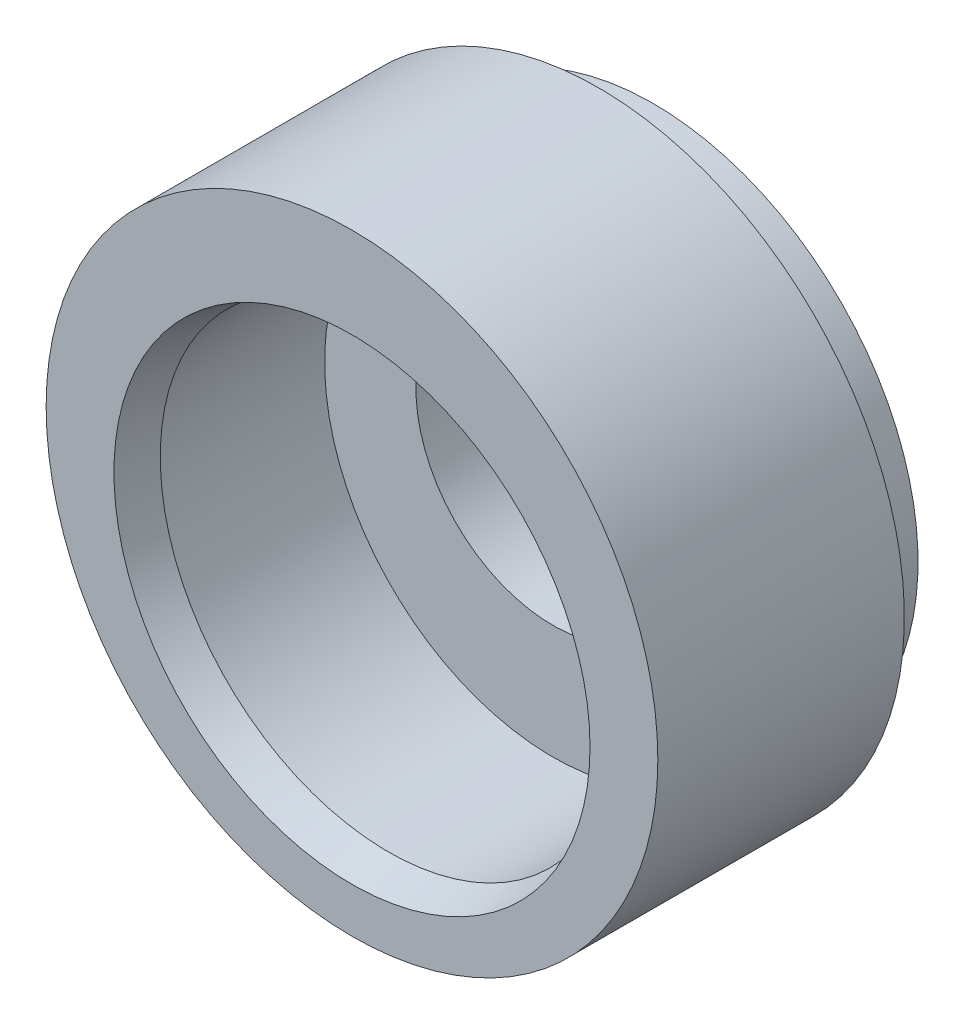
ISO-10303-21;
HEADER;
FILE_DESCRIPTION(('STEP AP214'),'2;1');
FILE_NAME('part.step','',(''),(''),'','','');
FILE_SCHEMA(('AUTOMOTIVE_DESIGN { 1 0 10303 214 1 1 1 1 }'));
ENDSEC;
DATA;
#1=APPLICATION_CONTEXT('core data for automotive mechanical design processes');
#2=APPLICATION_PROTOCOL_DEFINITION('international standard','automotive_design',2000,#1);
#3=PRODUCT_CONTEXT('',#1,'mechanical');
#4=PRODUCT('Part','Part','',(#3));
#5=PRODUCT_RELATED_PRODUCT_CATEGORY('part','',(#4));
#6=PRODUCT_DEFINITION_FORMATION('','',#4);
#7=PRODUCT_DEFINITION_CONTEXT('part definition',#1,'design');
#8=PRODUCT_DEFINITION('design','',#6,#7);
#9=PRODUCT_DEFINITION_SHAPE('','',#8);
#10=(LENGTH_UNIT() NAMED_UNIT(*) SI_UNIT(.MILLI.,.METRE.));
#11=(NAMED_UNIT(*) PLANE_ANGLE_UNIT() SI_UNIT($,.RADIAN.));
#12=(NAMED_UNIT(*) SI_UNIT($,.STERADIAN.) SOLID_ANGLE_UNIT());
#13=UNCERTAINTY_MEASURE_WITH_UNIT(LENGTH_MEASURE(1.E-05),#10,'distance_accuracy_value','');
#14=(GEOMETRIC_REPRESENTATION_CONTEXT(3) GLOBAL_UNCERTAINTY_ASSIGNED_CONTEXT((#13)) GLOBAL_UNIT_ASSIGNED_CONTEXT((#10,
#11,#12)) REPRESENTATION_CONTEXT('',''));
#15=CARTESIAN_POINT('',(0.,0.,0.));
#16=DIRECTION('',(0.,0.,1.));
#17=DIRECTION('',(1.,0.,0.));
#18=AXIS2_PLACEMENT_3D('',#15,#16,#17);
#19=CARTESIAN_POINT('',(0.,0.,0.));
#20=DIRECTION('',(0.,0.,1.));
#21=DIRECTION('',(1.,0.,0.));
#22=AXIS2_PLACEMENT_3D('',#19,#20,#21);
#23=PLANE('',#22);
#24=CARTESIAN_POINT('',(0.,0.,0.));
#25=DIRECTION('',(0.,0.,1.));
#26=DIRECTION('',(1.,0.,0.));
#27=AXIS2_PLACEMENT_3D('',#24,#25,#26);
#28=CIRCLE('',#27,3.81);
#29=CARTESIAN_POINT('',(3.81,0.,0.));
#30=VERTEX_POINT('',#29);
#31=EDGE_CURVE('E60',#30,#30,#28,.T.);
#32=ORIENTED_EDGE('',*,*,#31,.T.);
#33=EDGE_LOOP('',(#32));
#34=FACE_BOUND('',#33,.T.);
#35=CARTESIAN_POINT('',(0.,0.,0.));
#36=DIRECTION('',(0.,0.,-1.));
#37=DIRECTION('',(-1.,0.,0.));
#38=AXIS2_PLACEMENT_3D('',#35,#36,#37);
#39=CIRCLE('',#38,7.366);
#40=CARTESIAN_POINT('',(-7.366,0.,0.));
#41=VERTEX_POINT('',#40);
#42=EDGE_CURVE('E77',#41,#41,#39,.T.);
#43=ORIENTED_EDGE('',*,*,#42,.T.);
#44=EDGE_LOOP('',(#43));
#45=FACE_BOUND('',#44,.T.);
#46=ADVANCED_FACE('F45',(#34,#45),#23,.F.);
#47=CARTESIAN_POINT('',(0.,0.,8.382));
#48=DIRECTION('',(0.,0.,-1.));
#49=DIRECTION('',(-1.,0.,0.));
#50=AXIS2_PLACEMENT_3D('',#47,#48,#49);
#51=CYLINDRICAL_SURFACE('',#50,8.509);
#52=CARTESIAN_POINT('',(0.,0.,8.382));
#53=DIRECTION('',(0.,0.,1.));
#54=DIRECTION('',(1.,0.,0.));
#55=AXIS2_PLACEMENT_3D('',#52,#53,#54);
#56=CIRCLE('',#55,8.509);
#57=CARTESIAN_POINT('',(8.509,0.,8.382));
#58=VERTEX_POINT('',#57);
#59=EDGE_CURVE('E56',#58,#58,#56,.T.);
#60=ORIENTED_EDGE('',*,*,#59,.F.);
#61=EDGE_LOOP('',(#60));
#62=FACE_BOUND('',#61,.T.);
#63=CARTESIAN_POINT('',(0.,0.,1.524));
#64=DIRECTION('',(0.,0.,-1.));
#65=DIRECTION('',(-1.,0.,0.));
#66=AXIS2_PLACEMENT_3D('',#63,#64,#65);
#67=CIRCLE('',#66,8.509);
#68=CARTESIAN_POINT('',(-8.509,0.,1.524));
#69=VERTEX_POINT('',#68);
#70=EDGE_CURVE('E63',#69,#69,#67,.T.);
#71=ORIENTED_EDGE('',*,*,#70,.F.);
#72=EDGE_LOOP('',(#71));
#73=FACE_BOUND('',#72,.T.);
#74=ADVANCED_FACE('F47',(#62,#73),#51,.T.);
#75=CARTESIAN_POINT('',(0.,0.,8.382));
#76=DIRECTION('',(0.,0.,-1.));
#77=DIRECTION('',(-1.,0.,0.));
#78=AXIS2_PLACEMENT_3D('',#75,#76,#77);
#79=CYLINDRICAL_SURFACE('',#78,3.81);
#80=ORIENTED_EDGE('',*,*,#31,.F.);
#81=EDGE_LOOP('',(#80));
#82=FACE_BOUND('',#81,.T.);
#83=CARTESIAN_POINT('',(0.,0.,2.794));
#84=DIRECTION('',(0.,0.,1.));
#85=DIRECTION('',(1.,0.,0.));
#86=AXIS2_PLACEMENT_3D('',#83,#84,#85);
#87=CIRCLE('',#86,3.81);
#88=CARTESIAN_POINT('',(3.81,0.,2.794));
#89=VERTEX_POINT('',#88);
#90=EDGE_CURVE('E68',#89,#89,#87,.T.);
#91=ORIENTED_EDGE('',*,*,#90,.T.);
#92=EDGE_LOOP('',(#91));
#93=FACE_BOUND('',#92,.T.);
#94=ADVANCED_FACE('F103',(#82,#93),#79,.F.);
#95=CARTESIAN_POINT('',(0.,0.,8.382));
#96=DIRECTION('',(0.,0.,1.));
#97=DIRECTION('',(1.,0.,0.));
#98=AXIS2_PLACEMENT_3D('',#95,#96,#97);
#99=PLANE('',#98);
#100=CARTESIAN_POINT('',(0.,-0.635,8.382));
#101=DIRECTION('',(0.,0.,1.));
#102=DIRECTION('',(1.,0.,0.));
#103=AXIS2_PLACEMENT_3D('',#100,#101,#102);
#104=CIRCLE('',#103,6.62223637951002);
#105=CARTESIAN_POINT('',(6.62223637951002,-0.635,8.382));
#106=VERTEX_POINT('',#105);
#107=EDGE_CURVE('E12',#106,#106,#104,.F.);
#108=ORIENTED_EDGE('',*,*,#107,.T.);
#109=EDGE_LOOP('',(#108));
#110=FACE_BOUND('',#109,.T.);
#111=ORIENTED_EDGE('',*,*,#59,.T.);
#112=EDGE_LOOP('',(#111));
#113=FACE_BOUND('',#112,.T.);
#114=ADVANCED_FACE('F107',(#110,#113),#99,.T.);
#115=CARTESIAN_POINT('',(0.,-0.635,2.794));
#116=DIRECTION('',(0.,0.,1.));
#117=DIRECTION('',(1.,0.,0.));
#118=AXIS2_PLACEMENT_3D('',#115,#116,#117);
#119=CYLINDRICAL_SURFACE('',#118,6.35);
#120=CARTESIAN_POINT('',(0.,-0.635,7.36599999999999));
#121=DIRECTION('',(0.,0.,1.));
#122=DIRECTION('',(1.,0.,0.));
#123=AXIS2_PLACEMENT_3D('',#120,#121,#122);
#124=CIRCLE('',#123,6.35);
#125=CARTESIAN_POINT('',(6.35,-0.635,7.36599999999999));
#126=VERTEX_POINT('',#125);
#127=EDGE_CURVE('E52',#126,#126,#124,.T.);
#128=ORIENTED_EDGE('',*,*,#127,.T.);
#129=EDGE_LOOP('',(#128));
#130=FACE_BOUND('',#129,.T.);
#131=CARTESIAN_POINT('',(0.,-0.635,2.794));
#132=DIRECTION('',(0.,0.,1.));
#133=DIRECTION('',(1.,0.,0.));
#134=AXIS2_PLACEMENT_3D('',#131,#132,#133);
#135=CIRCLE('',#134,6.35);
#136=CARTESIAN_POINT('',(6.35,-0.635,2.794));
#137=VERTEX_POINT('',#136);
#138=EDGE_CURVE('E66',#137,#137,#135,.T.);
#139=ORIENTED_EDGE('',*,*,#138,.F.);
#140=EDGE_LOOP('',(#139));
#141=FACE_BOUND('',#140,.T.);
#142=ADVANCED_FACE('F109',(#130,#141),#119,.F.);
#143=CARTESIAN_POINT('',(0.,-0.635,2.794));
#144=DIRECTION('',(0.,0.,1.));
#145=DIRECTION('',(1.,0.,0.));
#146=AXIS2_PLACEMENT_3D('',#143,#144,#145);
#147=PLANE('',#146);
#148=ORIENTED_EDGE('',*,*,#90,.F.);
#149=EDGE_LOOP('',(#148));
#150=FACE_BOUND('',#149,.T.);
#151=ORIENTED_EDGE('',*,*,#138,.T.);
#152=EDGE_LOOP('',(#151));
#153=FACE_BOUND('',#152,.T.);
#154=ADVANCED_FACE('F94',(#150,#153),#147,.T.);
#155=CARTESIAN_POINT('',(0.,0.,1.524));
#156=DIRECTION('',(0.,0.,-1.));
#157=DIRECTION('',(-1.,0.,0.));
#158=AXIS2_PLACEMENT_3D('',#155,#156,#157);
#159=PLANE('',#158);
#160=CARTESIAN_POINT('',(0.,0.,1.524));
#161=DIRECTION('',(0.,0.,-1.));
#162=DIRECTION('',(-1.,0.,0.));
#163=AXIS2_PLACEMENT_3D('',#160,#161,#162);
#164=CIRCLE('',#163,7.366);
#165=CARTESIAN_POINT('',(-7.366,0.,1.524));
#166=VERTEX_POINT('',#165);
#167=EDGE_CURVE('E67',#166,#166,#164,.T.);
#168=ORIENTED_EDGE('',*,*,#167,.F.);
#169=EDGE_LOOP('',(#168));
#170=FACE_BOUND('',#169,.T.);
#171=ORIENTED_EDGE('',*,*,#70,.T.);
#172=EDGE_LOOP('',(#171));
#173=FACE_BOUND('',#172,.T.);
#174=ADVANCED_FACE('F85',(#170,#173),#159,.T.);
#175=CARTESIAN_POINT('',(0.,0.,1.524));
#176=DIRECTION('',(0.,0.,-1.));
#177=DIRECTION('',(-1.,0.,0.));
#178=AXIS2_PLACEMENT_3D('',#175,#176,#177);
#179=CYLINDRICAL_SURFACE('',#178,7.366);
#180=CARTESIAN_POINT('',(-7.366,0.,1.524));
#181=CARTESIAN_POINT('',(-7.366,0.,1.508125));
#182=CARTESIAN_POINT('',(-7.366,0.,1.49225));
#183=CARTESIAN_POINT('',(-7.366,0.,1.4605));
#184=CARTESIAN_POINT('',(-7.366,0.,1.444625));
#185=CARTESIAN_POINT('',(-7.366,0.,1.412875));
#186=CARTESIAN_POINT('',(-7.366,0.,1.397));
#187=CARTESIAN_POINT('',(-7.366,0.,1.36525));
#188=CARTESIAN_POINT('',(-7.366,0.,1.349375));
#189=CARTESIAN_POINT('',(-7.366,0.,1.317625));
#190=CARTESIAN_POINT('',(-7.366,0.,1.30175));
#191=CARTESIAN_POINT('',(-7.366,0.,1.27));
#192=CARTESIAN_POINT('',(-7.366,0.,1.254125));
#193=CARTESIAN_POINT('',(-7.366,0.,1.222375));
#194=CARTESIAN_POINT('',(-7.366,0.,1.2065));
#195=CARTESIAN_POINT('',(-7.366,0.,1.17475));
#196=CARTESIAN_POINT('',(-7.366,0.,1.158875));
#197=CARTESIAN_POINT('',(-7.366,0.,1.127125));
#198=CARTESIAN_POINT('',(-7.366,0.,1.11125));
#199=CARTESIAN_POINT('',(-7.366,0.,1.0795));
#200=CARTESIAN_POINT('',(-7.366,0.,1.063625));
#201=CARTESIAN_POINT('',(-7.366,0.,1.031875));
#202=CARTESIAN_POINT('',(-7.366,0.,1.016));
#203=CARTESIAN_POINT('',(-7.366,0.,0.98425));
#204=CARTESIAN_POINT('',(-7.366,0.,0.968375));
#205=CARTESIAN_POINT('',(-7.366,0.,0.936625));
#206=CARTESIAN_POINT('',(-7.366,0.,0.92075));
#207=CARTESIAN_POINT('',(-7.366,0.,0.889));
#208=CARTESIAN_POINT('',(-7.366,0.,0.873125));
#209=CARTESIAN_POINT('',(-7.366,0.,0.841375));
#210=CARTESIAN_POINT('',(-7.366,0.,0.8255));
#211=CARTESIAN_POINT('',(-7.366,0.,0.79375));
#212=CARTESIAN_POINT('',(-7.366,0.,0.777875));
#213=CARTESIAN_POINT('',(-7.366,0.,0.746125));
#214=CARTESIAN_POINT('',(-7.366,0.,0.73025));
#215=CARTESIAN_POINT('',(-7.366,0.,0.6985));
#216=CARTESIAN_POINT('',(-7.366,0.,0.682625));
#217=CARTESIAN_POINT('',(-7.366,0.,0.650875));
#218=CARTESIAN_POINT('',(-7.366,0.,0.635));
#219=CARTESIAN_POINT('',(-7.366,0.,0.60325));
#220=CARTESIAN_POINT('',(-7.366,0.,0.587375));
#221=CARTESIAN_POINT('',(-7.366,0.,0.555625));
#222=CARTESIAN_POINT('',(-7.366,0.,0.53975));
#223=CARTESIAN_POINT('',(-7.366,0.,0.508));
#224=CARTESIAN_POINT('',(-7.366,0.,0.492125));
#225=CARTESIAN_POINT('',(-7.366,0.,0.460375));
#226=CARTESIAN_POINT('',(-7.366,0.,0.4445));
#227=CARTESIAN_POINT('',(-7.366,0.,0.41275));
#228=CARTESIAN_POINT('',(-7.366,0.,0.396875));
#229=CARTESIAN_POINT('',(-7.366,0.,0.365125));
#230=CARTESIAN_POINT('',(-7.366,0.,0.34925));
#231=CARTESIAN_POINT('',(-7.366,0.,0.3175));
#232=CARTESIAN_POINT('',(-7.366,0.,0.301625));
#233=CARTESIAN_POINT('',(-7.366,0.,0.269875));
#234=CARTESIAN_POINT('',(-7.366,0.,0.254));
#235=CARTESIAN_POINT('',(-7.366,0.,0.22225));
#236=CARTESIAN_POINT('',(-7.366,0.,0.206375));
#237=CARTESIAN_POINT('',(-7.366,0.,0.174625));
#238=CARTESIAN_POINT('',(-7.366,0.,0.15875));
#239=CARTESIAN_POINT('',(-7.366,0.,0.127));
#240=CARTESIAN_POINT('',(-7.366,0.,0.111125));
#241=CARTESIAN_POINT('',(-7.366,0.,0.079375));
#242=CARTESIAN_POINT('',(-7.366,0.,0.0635));
#243=CARTESIAN_POINT('',(-7.366,0.,0.0317499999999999));
#244=CARTESIAN_POINT('',(-7.366,0.,0.015875));
#245=CARTESIAN_POINT('',(-7.366,0.,0.));
#246=B_SPLINE_CURVE_WITH_KNOTS('',3,(#180,#181,#182,#183,#184,#185,#186,#187,#188,#189,#190,
#191,#192,#193,#194,#195,#196,#197,#198,#199,#200,#201,#202,#203,#204,#205,#206,#207,#208,#209,
#210,#211,#212,#213,#214,#215,#216,#217,#218,#219,#220,#221,#222,#223,#224,#225,#226,#227,#228,
#229,#230,#231,#232,#233,#234,#235,#236,#237,#238,#239,#240,#241,#242,#243,#244,#245),
.UNSPECIFIED.,.F.,.F.,(4,2,2,2,2,2,2,2,2,2,2,2,2,2,2,2,2,2,2,2,2,2,2,2,2,2,2,2,2,2,2,2,4),(0.,
0.0476249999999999,0.0952499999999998,0.142875,0.1905,0.238125,0.28575,0.333375,0.381,0.428625,
0.47625,0.523875,0.5715,0.619125,0.66675,0.714375,0.762,0.809625,0.85725,0.904875,0.9525,
1.000125,1.04775,1.095375,1.143,1.190625,1.23825,1.285875,1.3335,1.381125,1.42875,1.476375,
1.524),.UNSPECIFIED.);
#247=EDGE_CURVE('BSEAM82',#166,#41,#246,.T.);
#248=ORIENTED_EDGE('',*,*,#167,.T.);
#249=ORIENTED_EDGE('',*,*,#42,.F.);
#250=ORIENTED_EDGE('',*,*,#247,.T.);
#251=ORIENTED_EDGE('',*,*,#247,.F.);
#252=EDGE_LOOP('',(#248,#250,#249,#251));
#253=FACE_BOUND('',#252,.T.);
#254=ADVANCED_FACE('F82',(#253),#179,.T.);
#255=CARTESIAN_POINT('',(0.,-0.635,7.36599999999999));
#256=DIRECTION('',(0.,0.,1.));
#257=DIRECTION('',(1.,0.,0.));
#258=AXIS2_PLACEMENT_3D('',#255,#256,#257);
#259=CONICAL_SURFACE('',#258,6.35,0.261799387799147);
#260=ORIENTED_EDGE('',*,*,#107,.F.);
#261=EDGE_LOOP('',(#260));
#262=FACE_BOUND('',#261,.T.);
#263=ORIENTED_EDGE('',*,*,#127,.F.);
#264=EDGE_LOOP('',(#263));
#265=FACE_BOUND('',#264,.T.);
#266=ADVANCED_FACE('F84',(#262,#265),#259,.F.);
#267=CLOSED_SHELL('',(#46,#74,#94,#114,#142,#154,#174,#254,#266));
#268=MANIFOLD_SOLID_BREP('B2',#267);
#269=ADVANCED_BREP_SHAPE_REPRESENTATION('',(#18,#268),#14);
#270=SHAPE_DEFINITION_REPRESENTATION(#9,#269);
ENDSEC;
END-ISO-10303-21;
